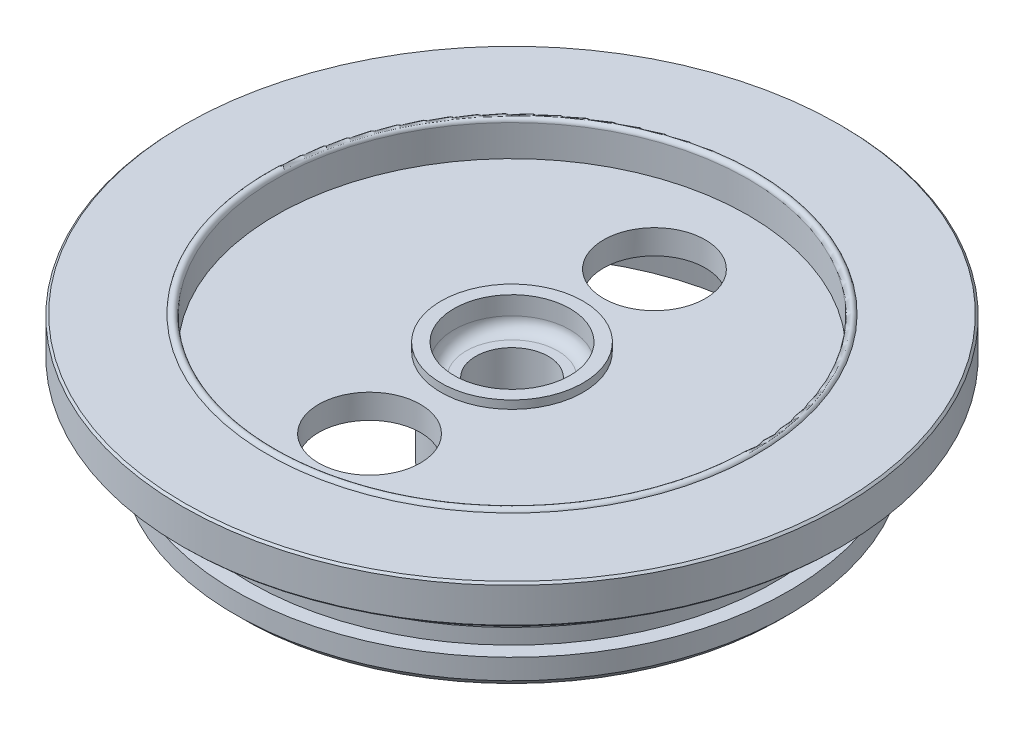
ISO-10303-21;
HEADER;
FILE_DESCRIPTION(('STEP AP214'),'2;1');
FILE_NAME('part.step','',(''),(''),'','','');
FILE_SCHEMA(('AUTOMOTIVE_DESIGN { 1 0 10303 214 1 1 1 1 }'));
ENDSEC;
DATA;
#1=APPLICATION_CONTEXT('core data for automotive mechanical design processes');
#2=APPLICATION_PROTOCOL_DEFINITION('international standard','automotive_design',2000,#1);
#3=PRODUCT_CONTEXT('',#1,'mechanical');
#4=PRODUCT('Part','Part','',(#3));
#5=PRODUCT_RELATED_PRODUCT_CATEGORY('part','',(#4));
#6=PRODUCT_DEFINITION_FORMATION('','',#4);
#7=PRODUCT_DEFINITION_CONTEXT('part definition',#1,'design');
#8=PRODUCT_DEFINITION('design','',#6,#7);
#9=PRODUCT_DEFINITION_SHAPE('','',#8);
#10=(LENGTH_UNIT() NAMED_UNIT(*) SI_UNIT(.MILLI.,.METRE.));
#11=(NAMED_UNIT(*) PLANE_ANGLE_UNIT() SI_UNIT($,.RADIAN.));
#12=(NAMED_UNIT(*) SI_UNIT($,.STERADIAN.) SOLID_ANGLE_UNIT());
#13=UNCERTAINTY_MEASURE_WITH_UNIT(LENGTH_MEASURE(1.E-05),#10,'distance_accuracy_value','');
#14=(GEOMETRIC_REPRESENTATION_CONTEXT(3) GLOBAL_UNCERTAINTY_ASSIGNED_CONTEXT((#13)) GLOBAL_UNIT_ASSIGNED_CONTEXT((#10,
#11,#12)) REPRESENTATION_CONTEXT('',''));
#15=CARTESIAN_POINT('',(0.,0.,0.));
#16=DIRECTION('',(0.,0.,1.));
#17=DIRECTION('',(1.,0.,0.));
#18=AXIS2_PLACEMENT_3D('',#15,#16,#17);
#19=CARTESIAN_POINT('',(0.,65.0403892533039,0.));
#20=DIRECTION('',(0.,-1.,0.));
#21=DIRECTION('',(0.,0.,-1.));
#22=AXIS2_PLACEMENT_3D('',#19,#20,#21);
#23=TOROIDAL_SURFACE('',#22,59.0036715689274,1.);
#24=CARTESIAN_POINT('',(0.,65.0403892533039,0.));
#25=DIRECTION('',(0.,-1.,0.));
#26=DIRECTION('',(0.,0.,-1.));
#27=AXIS2_PLACEMENT_3D('',#24,#25,#26);
#28=CIRCLE('',#27,58.0036715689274);
#29=CARTESIAN_POINT('',(0.,65.0403892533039,-58.0036715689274));
#30=VERTEX_POINT('',#29);
#31=EDGE_CURVE('E10',#30,#30,#28,.T.);
#32=ORIENTED_EDGE('',*,*,#31,.T.);
#33=EDGE_LOOP('',(#32));
#34=FACE_BOUND('',#33,.T.);
#35=CARTESIAN_POINT('',(0.,65.3610085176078,0.));
#36=DIRECTION('',(0.,-1.,0.));
#37=DIRECTION('',(0.,0.,-1.));
#38=AXIS2_PLACEMENT_3D('',#35,#36,#37);
#39=CIRCLE('',#38,59.9508797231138);
#40=CARTESIAN_POINT('',(0.,65.3610085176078,-59.9508797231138));
#41=VERTEX_POINT('',#40);
#42=EDGE_CURVE('E47',#41,#41,#39,.T.);
#43=ORIENTED_EDGE('',*,*,#42,.F.);
#44=EDGE_LOOP('',(#43));
#45=FACE_BOUND('',#44,.T.);
#46=ADVANCED_FACE('F30',(#34,#45),#23,.T.);
#47=CARTESIAN_POINT('',(0.,0.,0.));
#48=DIRECTION('',(0.,-1.,0.));
#49=DIRECTION('',(0.,0.,-1.));
#50=AXIS2_PLACEMENT_3D('',#47,#48,#49);
#51=CYLINDRICAL_SURFACE('',#50,58.0036715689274);
#52=CARTESIAN_POINT('',(0.,57.3610085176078,0.));
#53=DIRECTION('',(0.,-1.,0.));
#54=DIRECTION('',(0.,0.,-1.));
#55=AXIS2_PLACEMENT_3D('',#52,#53,#54);
#56=CIRCLE('',#55,58.0036715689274);
#57=CARTESIAN_POINT('',(0.,57.3610085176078,-58.0036715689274));
#58=VERTEX_POINT('',#57);
#59=EDGE_CURVE('E37',#58,#58,#56,.T.);
#60=ORIENTED_EDGE('',*,*,#59,.T.);
#61=EDGE_LOOP('',(#60));
#62=FACE_BOUND('',#61,.T.);
#63=ORIENTED_EDGE('',*,*,#31,.F.);
#64=EDGE_LOOP('',(#63));
#65=FACE_BOUND('',#64,.T.);
#66=ADVANCED_FACE('F150',(#62,#65),#51,.F.);
#67=CARTESIAN_POINT('',(58.0036715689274,57.3610085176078,0.));
#68=DIRECTION('',(0.,1.,0.));
#69=DIRECTION('',(0.,0.,1.));
#70=AXIS2_PLACEMENT_3D('',#67,#68,#69);
#71=PLANE('',#70);
#72=CARTESIAN_POINT('',(0.,57.3610085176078,35.));
#73=DIRECTION('',(0.,1.,0.));
#74=DIRECTION('',(0.,0.,1.));
#75=AXIS2_PLACEMENT_3D('',#72,#73,#74);
#76=CIRCLE('',#75,12.5);
#77=CARTESIAN_POINT('',(0.,57.3610085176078,47.5));
#78=VERTEX_POINT('',#77);
#79=EDGE_CURVE('E59',#78,#78,#76,.T.);
#80=ORIENTED_EDGE('',*,*,#79,.F.);
#81=EDGE_LOOP('',(#80));
#82=FACE_BOUND('',#81,.T.);
#83=CARTESIAN_POINT('',(0.,57.3610085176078,-35.));
#84=DIRECTION('',(0.,1.,0.));
#85=DIRECTION('',(0.,0.,1.));
#86=AXIS2_PLACEMENT_3D('',#83,#84,#85);
#87=CIRCLE('',#86,12.5);
#88=CARTESIAN_POINT('',(0.,57.3610085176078,-22.5));
#89=VERTEX_POINT('',#88);
#90=EDGE_CURVE('E48',#89,#89,#87,.T.);
#91=ORIENTED_EDGE('',*,*,#90,.F.);
#92=EDGE_LOOP('',(#91));
#93=FACE_BOUND('',#92,.T.);
#94=CARTESIAN_POINT('',(0.,57.3610085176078,0.));
#95=DIRECTION('',(0.,-1.,0.));
#96=DIRECTION('',(0.,0.,-1.));
#97=AXIS2_PLACEMENT_3D('',#94,#95,#96);
#98=CIRCLE('',#97,17.45);
#99=CARTESIAN_POINT('',(0.,57.3610085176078,-17.45));
#100=VERTEX_POINT('',#99);
#101=EDGE_CURVE('E42',#100,#100,#98,.T.);
#102=ORIENTED_EDGE('',*,*,#101,.T.);
#103=EDGE_LOOP('',(#102));
#104=FACE_BOUND('',#103,.T.);
#105=ORIENTED_EDGE('',*,*,#59,.F.);
#106=EDGE_LOOP('',(#105));
#107=FACE_BOUND('',#106,.T.);
#108=ADVANCED_FACE('F135',(#82,#93,#104,#107),#71,.T.);
#109=CARTESIAN_POINT('',(0.,0.,0.));
#110=DIRECTION('',(0.,-1.,0.));
#111=DIRECTION('',(0.,0.,-1.));
#112=AXIS2_PLACEMENT_3D('',#109,#110,#111);
#113=CYLINDRICAL_SURFACE('',#112,17.45);
#114=CARTESIAN_POINT('',(0.,59.3610085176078,0.));
#115=DIRECTION('',(0.,-1.,0.));
#116=DIRECTION('',(0.,0.,-1.));
#117=AXIS2_PLACEMENT_3D('',#114,#115,#116);
#118=CIRCLE('',#117,17.45);
#119=CARTESIAN_POINT('',(0.,59.3610085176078,-17.45));
#120=VERTEX_POINT('',#119);
#121=EDGE_CURVE('E130',#120,#120,#118,.T.);
#122=ORIENTED_EDGE('',*,*,#121,.T.);
#123=EDGE_LOOP('',(#122));
#124=FACE_BOUND('',#123,.T.);
#125=ORIENTED_EDGE('',*,*,#101,.F.);
#126=EDGE_LOOP('',(#125));
#127=FACE_BOUND('',#126,.T.);
#128=ADVANCED_FACE('F138',(#124,#127),#113,.T.);
#129=CARTESIAN_POINT('',(17.45,59.3610085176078,0.));
#130=DIRECTION('',(0.,1.,0.));
#131=DIRECTION('',(0.,0.,1.));
#132=AXIS2_PLACEMENT_3D('',#129,#130,#131);
#133=PLANE('',#132);
#134=CARTESIAN_POINT('',(0.,59.3610085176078,0.));
#135=DIRECTION('',(0.,-1.,0.));
#136=DIRECTION('',(0.,0.,-1.));
#137=AXIS2_PLACEMENT_3D('',#134,#135,#136);
#138=CIRCLE('',#137,14.25);
#139=CARTESIAN_POINT('',(0.,59.3610085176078,-14.25));
#140=VERTEX_POINT('',#139);
#141=EDGE_CURVE('E127',#140,#140,#138,.T.);
#142=ORIENTED_EDGE('',*,*,#141,.T.);
#143=EDGE_LOOP('',(#142));
#144=FACE_BOUND('',#143,.T.);
#145=ORIENTED_EDGE('',*,*,#121,.F.);
#146=EDGE_LOOP('',(#145));
#147=FACE_BOUND('',#146,.T.);
#148=ADVANCED_FACE('F140',(#144,#147),#133,.T.);
#149=CARTESIAN_POINT('',(0.,0.,0.));
#150=DIRECTION('',(0.,-1.,0.));
#151=DIRECTION('',(0.,0.,-1.));
#152=AXIS2_PLACEMENT_3D('',#149,#150,#151);
#153=CYLINDRICAL_SURFACE('',#152,14.25);
#154=CARTESIAN_POINT('',(0.,54.8610085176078,0.));
#155=DIRECTION('',(0.,-1.,0.));
#156=DIRECTION('',(0.,0.,-1.));
#157=AXIS2_PLACEMENT_3D('',#154,#155,#156);
#158=CIRCLE('',#157,14.25);
#159=CARTESIAN_POINT('',(0.,54.8610085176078,-14.25));
#160=VERTEX_POINT('',#159);
#161=EDGE_CURVE('E124',#160,#160,#158,.T.);
#162=ORIENTED_EDGE('',*,*,#161,.T.);
#163=EDGE_LOOP('',(#162));
#164=FACE_BOUND('',#163,.T.);
#165=ORIENTED_EDGE('',*,*,#141,.F.);
#166=EDGE_LOOP('',(#165));
#167=FACE_BOUND('',#166,.T.);
#168=ADVANCED_FACE('F147',(#164,#167),#153,.F.);
#169=CARTESIAN_POINT('',(0.,54.8610085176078,0.));
#170=DIRECTION('',(0.,-1.,0.));
#171=DIRECTION('',(0.,0.,-1.));
#172=AXIS2_PLACEMENT_3D('',#169,#170,#171);
#173=TOROIDAL_SURFACE('',#172,11.25,3.);
#174=CARTESIAN_POINT('',(0.,51.8610085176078,0.));
#175=DIRECTION('',(0.,-1.,0.));
#176=DIRECTION('',(0.,0.,-1.));
#177=AXIS2_PLACEMENT_3D('',#174,#175,#176);
#178=CIRCLE('',#177,11.25);
#179=CARTESIAN_POINT('',(0.,51.8610085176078,-11.25));
#180=VERTEX_POINT('',#179);
#181=EDGE_CURVE('E121',#180,#180,#178,.T.);
#182=ORIENTED_EDGE('',*,*,#181,.T.);
#183=EDGE_LOOP('',(#182));
#184=FACE_BOUND('',#183,.T.);
#185=ORIENTED_EDGE('',*,*,#161,.F.);
#186=EDGE_LOOP('',(#185));
#187=FACE_BOUND('',#186,.T.);
#188=ADVANCED_FACE('F286',(#184,#187),#173,.F.);
#189=CARTESIAN_POINT('',(8.925,51.8610085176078,0.));
#190=DIRECTION('',(0.,1.,0.));
#191=DIRECTION('',(0.,0.,1.));
#192=AXIS2_PLACEMENT_3D('',#189,#190,#191);
#193=PLANE('',#192);
#194=CARTESIAN_POINT('',(0.,51.8610085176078,0.));
#195=DIRECTION('',(0.,-1.,0.));
#196=DIRECTION('',(0.,0.,-1.));
#197=AXIS2_PLACEMENT_3D('',#194,#195,#196);
#198=CIRCLE('',#197,8.925);
#199=CARTESIAN_POINT('',(0.,51.8610085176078,-8.925));
#200=VERTEX_POINT('',#199);
#201=EDGE_CURVE('E118',#200,#200,#198,.T.);
#202=ORIENTED_EDGE('',*,*,#201,.T.);
#203=EDGE_LOOP('',(#202));
#204=FACE_BOUND('',#203,.T.);
#205=ORIENTED_EDGE('',*,*,#181,.F.);
#206=EDGE_LOOP('',(#205));
#207=FACE_BOUND('',#206,.T.);
#208=ADVANCED_FACE('F280',(#204,#207),#193,.T.);
#209=CARTESIAN_POINT('',(0.,0.,0.));
#210=DIRECTION('',(0.,-1.,0.));
#211=DIRECTION('',(0.,0.,-1.));
#212=AXIS2_PLACEMENT_3D('',#209,#210,#211);
#213=CYLINDRICAL_SURFACE('',#212,8.925);
#214=CARTESIAN_POINT('',(0.,5.36100851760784,0.));
#215=DIRECTION('',(0.,-1.,0.));
#216=DIRECTION('',(0.,0.,-1.));
#217=AXIS2_PLACEMENT_3D('',#214,#215,#216);
#218=CIRCLE('',#217,8.92499999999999);
#219=CARTESIAN_POINT('',(0.,5.36100851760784,-8.92499999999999));
#220=VERTEX_POINT('',#219);
#221=EDGE_CURVE('E115',#220,#220,#218,.T.);
#222=ORIENTED_EDGE('',*,*,#221,.T.);
#223=EDGE_LOOP('',(#222));
#224=FACE_BOUND('',#223,.T.);
#225=ORIENTED_EDGE('',*,*,#201,.F.);
#226=EDGE_LOOP('',(#225));
#227=FACE_BOUND('',#226,.T.);
#228=ADVANCED_FACE('F274',(#224,#227),#213,.F.);
#229=CARTESIAN_POINT('',(8.92499999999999,5.36100851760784,0.));
#230=DIRECTION('',(0.,-1.,0.));
#231=DIRECTION('',(0.,0.,-1.));
#232=AXIS2_PLACEMENT_3D('',#229,#230,#231);
#233=PLANE('',#232);
#234=CARTESIAN_POINT('',(0.,5.36100851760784,0.));
#235=DIRECTION('',(0.,-1.,0.));
#236=DIRECTION('',(0.,0.,-1.));
#237=AXIS2_PLACEMENT_3D('',#234,#235,#236);
#238=CIRCLE('',#237,12.8);
#239=CARTESIAN_POINT('',(0.,5.36100851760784,-12.8));
#240=VERTEX_POINT('',#239);
#241=EDGE_CURVE('E112',#240,#240,#238,.T.);
#242=ORIENTED_EDGE('',*,*,#241,.T.);
#243=EDGE_LOOP('',(#242));
#244=FACE_BOUND('',#243,.T.);
#245=ORIENTED_EDGE('',*,*,#221,.F.);
#246=EDGE_LOOP('',(#245));
#247=FACE_BOUND('',#246,.T.);
#248=ADVANCED_FACE('F268',(#244,#247),#233,.T.);
#249=CARTESIAN_POINT('',(0.,5.36100851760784,0.));
#250=DIRECTION('',(0.,1.,0.));
#251=DIRECTION('',(0.,0.,1.));
#252=AXIS2_PLACEMENT_3D('',#249,#250,#251);
#253=CONICAL_SURFACE('',#252,12.8,0.785398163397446);
#254=CARTESIAN_POINT('',(0.,6.36100851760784,0.));
#255=DIRECTION('',(0.,-1.,0.));
#256=DIRECTION('',(0.,0.,-1.));
#257=AXIS2_PLACEMENT_3D('',#254,#255,#256);
#258=CIRCLE('',#257,13.8);
#259=CARTESIAN_POINT('',(0.,6.36100851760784,-13.8));
#260=VERTEX_POINT('',#259);
#261=EDGE_CURVE('E109',#260,#260,#258,.T.);
#262=ORIENTED_EDGE('',*,*,#261,.T.);
#263=EDGE_LOOP('',(#262));
#264=FACE_BOUND('',#263,.T.);
#265=ORIENTED_EDGE('',*,*,#241,.F.);
#266=EDGE_LOOP('',(#265));
#267=FACE_BOUND('',#266,.T.);
#268=ADVANCED_FACE('F262',(#264,#267),#253,.T.);
#269=CARTESIAN_POINT('',(0.,0.,0.));
#270=DIRECTION('',(0.,-1.,0.));
#271=DIRECTION('',(0.,0.,-1.));
#272=AXIS2_PLACEMENT_3D('',#269,#270,#271);
#273=CYLINDRICAL_SURFACE('',#272,13.8);
#274=CARTESIAN_POINT('',(0.,34.4986106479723,0.));
#275=DIRECTION('',(0.,-1.,0.));
#276=DIRECTION('',(0.,0.,-1.));
#277=AXIS2_PLACEMENT_3D('',#274,#275,#276);
#278=CIRCLE('',#277,13.8);
#279=CARTESIAN_POINT('',(0.,34.4986106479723,-13.8));
#280=VERTEX_POINT('',#279);
#281=EDGE_CURVE('E106',#280,#280,#278,.T.);
#282=ORIENTED_EDGE('',*,*,#281,.T.);
#283=EDGE_LOOP('',(#282));
#284=FACE_BOUND('',#283,.T.);
#285=ORIENTED_EDGE('',*,*,#261,.F.);
#286=EDGE_LOOP('',(#285));
#287=FACE_BOUND('',#286,.T.);
#288=ADVANCED_FACE('F256',(#284,#287),#273,.T.);
#289=CARTESIAN_POINT('',(13.8,34.4986106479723,0.));
#290=DIRECTION('',(0.,-1.,0.));
#291=DIRECTION('',(0.,0.,-1.));
#292=AXIS2_PLACEMENT_3D('',#289,#290,#291);
#293=PLANE('',#292);
#294=CARTESIAN_POINT('',(0.,34.4986106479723,0.));
#295=DIRECTION('',(0.,-1.,0.));
#296=DIRECTION('',(0.,0.,-1.));
#297=AXIS2_PLACEMENT_3D('',#294,#295,#296);
#298=CIRCLE('',#297,16.8);
#299=CARTESIAN_POINT('',(0.,34.4986106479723,-16.8));
#300=VERTEX_POINT('',#299);
#301=EDGE_CURVE('E103',#300,#300,#298,.T.);
#302=ORIENTED_EDGE('',*,*,#301,.T.);
#303=EDGE_LOOP('',(#302));
#304=FACE_BOUND('',#303,.T.);
#305=ORIENTED_EDGE('',*,*,#281,.F.);
#306=EDGE_LOOP('',(#305));
#307=FACE_BOUND('',#306,.T.);
#308=ADVANCED_FACE('F250',(#304,#307),#293,.T.);
#309=CARTESIAN_POINT('',(0.,0.,0.));
#310=DIRECTION('',(0.,-1.,0.));
#311=DIRECTION('',(0.,0.,-1.));
#312=AXIS2_PLACEMENT_3D('',#309,#310,#311);
#313=CYLINDRICAL_SURFACE('',#312,16.8);
#314=CARTESIAN_POINT('',(0.,51.3610085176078,0.));
#315=DIRECTION('',(0.,-1.,0.));
#316=DIRECTION('',(0.,0.,-1.));
#317=AXIS2_PLACEMENT_3D('',#314,#315,#316);
#318=CIRCLE('',#317,16.8);
#319=CARTESIAN_POINT('',(0.,51.3610085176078,-16.8));
#320=VERTEX_POINT('',#319);
#321=EDGE_CURVE('E100',#320,#320,#318,.T.);
#322=ORIENTED_EDGE('',*,*,#321,.T.);
#323=EDGE_LOOP('',(#322));
#324=FACE_BOUND('',#323,.T.);
#325=ORIENTED_EDGE('',*,*,#301,.F.);
#326=EDGE_LOOP('',(#325));
#327=FACE_BOUND('',#326,.T.);
#328=ADVANCED_FACE('F243',(#324,#327),#313,.T.);
#329=CARTESIAN_POINT('',(16.8,51.3610085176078,0.));
#330=DIRECTION('',(0.,-1.,0.));
#331=DIRECTION('',(0.,0.,-1.));
#332=AXIS2_PLACEMENT_3D('',#329,#330,#331);
#333=PLANE('',#332);
#334=CARTESIAN_POINT('',(0.,51.3610085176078,35.));
#335=DIRECTION('',(0.,-1.,0.));
#336=DIRECTION('',(0.,0.,-1.));
#337=AXIS2_PLACEMENT_3D('',#334,#335,#336);
#338=CIRCLE('',#337,12.5);
#339=CARTESIAN_POINT('',(0.,51.3610085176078,22.5));
#340=VERTEX_POINT('',#339);
#341=EDGE_CURVE('E33',#340,#340,#338,.T.);
#342=ORIENTED_EDGE('',*,*,#341,.F.);
#343=EDGE_LOOP('',(#342));
#344=FACE_BOUND('',#343,.T.);
#345=CARTESIAN_POINT('',(0.,51.3610085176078,-35.));
#346=DIRECTION('',(0.,-1.,0.));
#347=DIRECTION('',(0.,0.,-1.));
#348=AXIS2_PLACEMENT_3D('',#345,#346,#347);
#349=CIRCLE('',#348,12.5);
#350=CARTESIAN_POINT('',(0.,51.3610085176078,-47.5));
#351=VERTEX_POINT('',#350);
#352=EDGE_CURVE('E45',#351,#351,#349,.T.);
#353=ORIENTED_EDGE('',*,*,#352,.F.);
#354=EDGE_LOOP('',(#353));
#355=FACE_BOUND('',#354,.T.);
#356=CARTESIAN_POINT('',(0.,51.3610085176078,0.));
#357=DIRECTION('',(0.,-1.,0.));
#358=DIRECTION('',(0.,0.,-1.));
#359=AXIS2_PLACEMENT_3D('',#356,#357,#358);
#360=CIRCLE('',#359,59.6490800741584);
#361=CARTESIAN_POINT('',(0.,51.3610085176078,-59.6490800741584));
#362=VERTEX_POINT('',#361);
#363=EDGE_CURVE('E97',#362,#362,#360,.T.);
#364=ORIENTED_EDGE('',*,*,#363,.T.);
#365=EDGE_LOOP('',(#364));
#366=FACE_BOUND('',#365,.T.);
#367=ORIENTED_EDGE('',*,*,#321,.F.);
#368=EDGE_LOOP('',(#367));
#369=FACE_BOUND('',#368,.T.);
#370=ADVANCED_FACE('F237',(#344,#355,#366,#369),#333,.T.);
#371=CARTESIAN_POINT('',(0.,51.3610085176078,0.));
#372=DIRECTION('',(0.,-1.,0.));
#373=DIRECTION('',(0.,0.,-1.));
#374=AXIS2_PLACEMENT_3D('',#371,#372,#373);
#375=CONICAL_SURFACE('',#374,59.6490800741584,0.157079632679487);
#376=CARTESIAN_POINT('',(0.,33.3610085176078,0.));
#377=DIRECTION('',(0.,-1.,0.));
#378=DIRECTION('',(0.,0.,-1.));
#379=AXIS2_PLACEMENT_3D('',#376,#377,#378);
#380=CIRCLE('',#379,62.5);
#381=CARTESIAN_POINT('',(0.,33.3610085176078,-62.5));
#382=VERTEX_POINT('',#381);
#383=EDGE_CURVE('E94',#382,#382,#380,.T.);
#384=ORIENTED_EDGE('',*,*,#383,.T.);
#385=EDGE_LOOP('',(#384));
#386=FACE_BOUND('',#385,.T.);
#387=ORIENTED_EDGE('',*,*,#363,.F.);
#388=EDGE_LOOP('',(#387));
#389=FACE_BOUND('',#388,.T.);
#390=ADVANCED_FACE('F231',(#386,#389),#375,.F.);
#391=CARTESIAN_POINT('',(62.5,33.3610085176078,0.));
#392=DIRECTION('',(0.,-1.,0.));
#393=DIRECTION('',(0.,0.,-1.));
#394=AXIS2_PLACEMENT_3D('',#391,#392,#393);
#395=PLANE('',#394);
#396=CARTESIAN_POINT('',(0.,33.3610085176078,0.));
#397=DIRECTION('',(0.,-1.,0.));
#398=DIRECTION('',(0.,0.,-1.));
#399=AXIS2_PLACEMENT_3D('',#396,#397,#398);
#400=CIRCLE('',#399,66.);
#401=CARTESIAN_POINT('',(0.,33.3610085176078,-66.));
#402=VERTEX_POINT('',#401);
#403=EDGE_CURVE('E91',#402,#402,#400,.T.);
#404=ORIENTED_EDGE('',*,*,#403,.T.);
#405=EDGE_LOOP('',(#404));
#406=FACE_BOUND('',#405,.T.);
#407=ORIENTED_EDGE('',*,*,#383,.F.);
#408=EDGE_LOOP('',(#407));
#409=FACE_BOUND('',#408,.T.);
#410=ADVANCED_FACE('F225',(#406,#409),#395,.T.);
#411=CARTESIAN_POINT('',(0.,33.3610085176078,0.));
#412=DIRECTION('',(0.,1.,0.));
#413=DIRECTION('',(0.,0.,1.));
#414=AXIS2_PLACEMENT_3D('',#411,#412,#413);
#415=CONICAL_SURFACE('',#414,66.,0.785398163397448);
#416=CARTESIAN_POINT('',(0.,35.3610085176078,0.));
#417=DIRECTION('',(0.,-1.,0.));
#418=DIRECTION('',(0.,0.,-1.));
#419=AXIS2_PLACEMENT_3D('',#416,#417,#418);
#420=CIRCLE('',#419,68.);
#421=CARTESIAN_POINT('',(0.,35.3610085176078,-68.));
#422=VERTEX_POINT('',#421);
#423=EDGE_CURVE('E88',#422,#422,#420,.T.);
#424=ORIENTED_EDGE('',*,*,#423,.T.);
#425=EDGE_LOOP('',(#424));
#426=FACE_BOUND('',#425,.T.);
#427=ORIENTED_EDGE('',*,*,#403,.F.);
#428=EDGE_LOOP('',(#427));
#429=FACE_BOUND('',#428,.T.);
#430=ADVANCED_FACE('F219',(#426,#429),#415,.T.);
#431=CARTESIAN_POINT('',(0.,0.,0.));
#432=DIRECTION('',(0.,-1.,0.));
#433=DIRECTION('',(0.,0.,-1.));
#434=AXIS2_PLACEMENT_3D('',#431,#432,#433);
#435=CYLINDRICAL_SURFACE('',#434,68.);
#436=CARTESIAN_POINT('',(0.,40.3610085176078,0.));
#437=DIRECTION('',(0.,-1.,0.));
#438=DIRECTION('',(0.,0.,-1.));
#439=AXIS2_PLACEMENT_3D('',#436,#437,#438);
#440=CIRCLE('',#439,68.);
#441=CARTESIAN_POINT('',(0.,40.3610085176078,-68.));
#442=VERTEX_POINT('',#441);
#443=EDGE_CURVE('E85',#442,#442,#440,.T.);
#444=ORIENTED_EDGE('',*,*,#443,.T.);
#445=EDGE_LOOP('',(#444));
#446=FACE_BOUND('',#445,.T.);
#447=ORIENTED_EDGE('',*,*,#423,.F.);
#448=EDGE_LOOP('',(#447));
#449=FACE_BOUND('',#448,.T.);
#450=ADVANCED_FACE('F213',(#446,#449),#435,.T.);
#451=CARTESIAN_POINT('',(64.35,40.3610085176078,0.));
#452=DIRECTION('',(0.,1.,0.));
#453=DIRECTION('',(0.,0.,1.));
#454=AXIS2_PLACEMENT_3D('',#451,#452,#453);
#455=PLANE('',#454);
#456=CARTESIAN_POINT('',(0.,40.3610085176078,0.));
#457=DIRECTION('',(0.,-1.,0.));
#458=DIRECTION('',(0.,0.,-1.));
#459=AXIS2_PLACEMENT_3D('',#456,#457,#458);
#460=CIRCLE('',#459,64.35);
#461=CARTESIAN_POINT('',(0.,40.3610085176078,-64.35));
#462=VERTEX_POINT('',#461);
#463=EDGE_CURVE('E82',#462,#462,#460,.T.);
#464=ORIENTED_EDGE('',*,*,#463,.T.);
#465=EDGE_LOOP('',(#464));
#466=FACE_BOUND('',#465,.T.);
#467=ORIENTED_EDGE('',*,*,#443,.F.);
#468=EDGE_LOOP('',(#467));
#469=FACE_BOUND('',#468,.T.);
#470=ADVANCED_FACE('F207',(#466,#469),#455,.T.);
#471=CARTESIAN_POINT('',(0.,0.,0.));
#472=DIRECTION('',(0.,-1.,0.));
#473=DIRECTION('',(0.,0.,-1.));
#474=AXIS2_PLACEMENT_3D('',#471,#472,#473);
#475=CYLINDRICAL_SURFACE('',#474,64.35);
#476=CARTESIAN_POINT('',(0.,46.7110085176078,0.));
#477=DIRECTION('',(0.,-1.,0.));
#478=DIRECTION('',(0.,0.,-1.));
#479=AXIS2_PLACEMENT_3D('',#476,#477,#478);
#480=CIRCLE('',#479,64.35);
#481=CARTESIAN_POINT('',(0.,46.7110085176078,-64.35));
#482=VERTEX_POINT('',#481);
#483=EDGE_CURVE('E79',#482,#482,#480,.T.);
#484=ORIENTED_EDGE('',*,*,#483,.T.);
#485=EDGE_LOOP('',(#484));
#486=FACE_BOUND('',#485,.T.);
#487=ORIENTED_EDGE('',*,*,#463,.F.);
#488=EDGE_LOOP('',(#487));
#489=FACE_BOUND('',#488,.T.);
#490=ADVANCED_FACE('F201',(#486,#489),#475,.T.);
#491=CARTESIAN_POINT('',(68.,46.7110085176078,0.));
#492=DIRECTION('',(0.,-1.,0.));
#493=DIRECTION('',(0.,0.,-1.));
#494=AXIS2_PLACEMENT_3D('',#491,#492,#493);
#495=PLANE('',#494);
#496=CARTESIAN_POINT('',(0.,46.7110085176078,0.));
#497=DIRECTION('',(0.,-1.,0.));
#498=DIRECTION('',(0.,0.,-1.));
#499=AXIS2_PLACEMENT_3D('',#496,#497,#498);
#500=CIRCLE('',#499,68.);
#501=CARTESIAN_POINT('',(0.,46.7110085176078,-68.));
#502=VERTEX_POINT('',#501);
#503=EDGE_CURVE('E76',#502,#502,#500,.T.);
#504=ORIENTED_EDGE('',*,*,#503,.T.);
#505=EDGE_LOOP('',(#504));
#506=FACE_BOUND('',#505,.T.);
#507=ORIENTED_EDGE('',*,*,#483,.F.);
#508=EDGE_LOOP('',(#507));
#509=FACE_BOUND('',#508,.T.);
#510=ADVANCED_FACE('F195',(#506,#509),#495,.T.);
#511=CARTESIAN_POINT('',(0.,0.,0.));
#512=DIRECTION('',(0.,-1.,0.));
#513=DIRECTION('',(0.,0.,-1.));
#514=AXIS2_PLACEMENT_3D('',#511,#512,#513);
#515=CYLINDRICAL_SURFACE('',#514,68.);
#516=CARTESIAN_POINT('',(0.,55.8610085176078,0.));
#517=DIRECTION('',(0.,-1.,0.));
#518=DIRECTION('',(0.,0.,-1.));
#519=AXIS2_PLACEMENT_3D('',#516,#517,#518);
#520=CIRCLE('',#519,68.);
#521=CARTESIAN_POINT('',(0.,55.8610085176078,-68.));
#522=VERTEX_POINT('',#521);
#523=EDGE_CURVE('E73',#522,#522,#520,.T.);
#524=ORIENTED_EDGE('',*,*,#523,.T.);
#525=EDGE_LOOP('',(#524));
#526=FACE_BOUND('',#525,.T.);
#527=ORIENTED_EDGE('',*,*,#503,.F.);
#528=EDGE_LOOP('',(#527));
#529=FACE_BOUND('',#528,.T.);
#530=ADVANCED_FACE('F189',(#526,#529),#515,.T.);
#531=CARTESIAN_POINT('',(68.,55.8610085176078,0.));
#532=DIRECTION('',(0.,-1.,0.));
#533=DIRECTION('',(0.,0.,-1.));
#534=AXIS2_PLACEMENT_3D('',#531,#532,#533);
#535=PLANE('',#534);
#536=CARTESIAN_POINT('',(0.,55.8610085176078,0.));
#537=DIRECTION('',(0.,-1.,0.));
#538=DIRECTION('',(0.,0.,-1.));
#539=AXIS2_PLACEMENT_3D('',#536,#537,#538);
#540=CIRCLE('',#539,80.5);
#541=CARTESIAN_POINT('',(0.,55.8610085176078,-80.5));
#542=VERTEX_POINT('',#541);
#543=EDGE_CURVE('E70',#542,#542,#540,.T.);
#544=ORIENTED_EDGE('',*,*,#543,.T.);
#545=EDGE_LOOP('',(#544));
#546=FACE_BOUND('',#545,.T.);
#547=ORIENTED_EDGE('',*,*,#523,.F.);
#548=EDGE_LOOP('',(#547));
#549=FACE_BOUND('',#548,.T.);
#550=ADVANCED_FACE('F183',(#546,#549),#535,.T.);
#551=CARTESIAN_POINT('',(0.,55.8610085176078,0.));
#552=DIRECTION('',(0.,1.,0.));
#553=DIRECTION('',(0.,0.,1.));
#554=AXIS2_PLACEMENT_3D('',#551,#552,#553);
#555=CONICAL_SURFACE('',#554,80.5,0.785398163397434);
#556=CARTESIAN_POINT('',(0.,56.3610085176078,0.));
#557=DIRECTION('',(0.,-1.,0.));
#558=DIRECTION('',(0.,0.,-1.));
#559=AXIS2_PLACEMENT_3D('',#556,#557,#558);
#560=CIRCLE('',#559,81.);
#561=CARTESIAN_POINT('',(0.,56.3610085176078,-81.));
#562=VERTEX_POINT('',#561);
#563=EDGE_CURVE('E67',#562,#562,#560,.T.);
#564=ORIENTED_EDGE('',*,*,#563,.T.);
#565=EDGE_LOOP('',(#564));
#566=FACE_BOUND('',#565,.T.);
#567=ORIENTED_EDGE('',*,*,#543,.F.);
#568=EDGE_LOOP('',(#567));
#569=FACE_BOUND('',#568,.T.);
#570=ADVANCED_FACE('F177',(#566,#569),#555,.T.);
#571=CARTESIAN_POINT('',(0.,0.,0.));
#572=DIRECTION('',(0.,-1.,0.));
#573=DIRECTION('',(0.,0.,-1.));
#574=AXIS2_PLACEMENT_3D('',#571,#572,#573);
#575=CYLINDRICAL_SURFACE('',#574,81.);
#576=CARTESIAN_POINT('',(0.,64.8610085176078,0.));
#577=DIRECTION('',(0.,-1.,0.));
#578=DIRECTION('',(0.,0.,-1.));
#579=AXIS2_PLACEMENT_3D('',#576,#577,#578);
#580=CIRCLE('',#579,81.);
#581=CARTESIAN_POINT('',(0.,64.8610085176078,-81.));
#582=VERTEX_POINT('',#581);
#583=EDGE_CURVE('E64',#582,#582,#580,.T.);
#584=ORIENTED_EDGE('',*,*,#583,.T.);
#585=EDGE_LOOP('',(#584));
#586=FACE_BOUND('',#585,.T.);
#587=ORIENTED_EDGE('',*,*,#563,.F.);
#588=EDGE_LOOP('',(#587));
#589=FACE_BOUND('',#588,.T.);
#590=ADVANCED_FACE('F171',(#586,#589),#575,.T.);
#591=CARTESIAN_POINT('',(0.,64.8610085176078,0.));
#592=DIRECTION('',(0.,-1.,0.));
#593=DIRECTION('',(0.,0.,-1.));
#594=AXIS2_PLACEMENT_3D('',#591,#592,#593);
#595=CONICAL_SURFACE('',#594,81.,0.785398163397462);
#596=CARTESIAN_POINT('',(0.,65.3610085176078,0.));
#597=DIRECTION('',(0.,-1.,0.));
#598=DIRECTION('',(0.,0.,-1.));
#599=AXIS2_PLACEMENT_3D('',#596,#597,#598);
#600=CIRCLE('',#599,80.5);
#601=CARTESIAN_POINT('',(0.,65.3610085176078,-80.5));
#602=VERTEX_POINT('',#601);
#603=EDGE_CURVE('E52',#602,#602,#600,.T.);
#604=ORIENTED_EDGE('',*,*,#603,.T.);
#605=EDGE_LOOP('',(#604));
#606=FACE_BOUND('',#605,.T.);
#607=ORIENTED_EDGE('',*,*,#583,.F.);
#608=EDGE_LOOP('',(#607));
#609=FACE_BOUND('',#608,.T.);
#610=ADVANCED_FACE('F165',(#606,#609),#595,.T.);
#611=CARTESIAN_POINT('',(80.5,65.3610085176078,0.));
#612=DIRECTION('',(0.,1.,0.));
#613=DIRECTION('',(0.,0.,1.));
#614=AXIS2_PLACEMENT_3D('',#611,#612,#613);
#615=PLANE('',#614);
#616=ORIENTED_EDGE('',*,*,#42,.T.);
#617=EDGE_LOOP('',(#616));
#618=FACE_BOUND('',#617,.T.);
#619=ORIENTED_EDGE('',*,*,#603,.F.);
#620=EDGE_LOOP('',(#619));
#621=FACE_BOUND('',#620,.T.);
#622=ADVANCED_FACE('F161',(#618,#621),#615,.T.);
#623=CARTESIAN_POINT('',(0.,47.3610085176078,-35.));
#624=DIRECTION('',(0.,1.,0.));
#625=DIRECTION('',(0.,0.,1.));
#626=AXIS2_PLACEMENT_3D('',#623,#624,#625);
#627=CYLINDRICAL_SURFACE('',#626,12.5);
#628=ORIENTED_EDGE('',*,*,#352,.T.);
#629=EDGE_LOOP('',(#628));
#630=FACE_BOUND('',#629,.T.);
#631=ORIENTED_EDGE('',*,*,#90,.T.);
#632=EDGE_LOOP('',(#631));
#633=FACE_BOUND('',#632,.T.);
#634=ADVANCED_FACE('F164',(#630,#633),#627,.F.);
#635=CARTESIAN_POINT('',(0.,47.3610085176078,35.));
#636=DIRECTION('',(0.,1.,0.));
#637=DIRECTION('',(0.,0.,1.));
#638=AXIS2_PLACEMENT_3D('',#635,#636,#637);
#639=CYLINDRICAL_SURFACE('',#638,12.5);
#640=ORIENTED_EDGE('',*,*,#341,.T.);
#641=EDGE_LOOP('',(#640));
#642=FACE_BOUND('',#641,.T.);
#643=ORIENTED_EDGE('',*,*,#79,.T.);
#644=EDGE_LOOP('',(#643));
#645=FACE_BOUND('',#644,.T.);
#646=ADVANCED_FACE('F306',(#642,#645),#639,.F.);
#647=CLOSED_SHELL('',(#46,#66,#108,#128,#148,#168,#188,#208,#228,#248,#268,#288,#308,#328,#370,
#390,#410,#430,#450,#470,#490,#510,#530,#550,#570,#590,#610,#622,#634,#646));
#648=MANIFOLD_SOLID_BREP('B2',#647);
#649=ADVANCED_BREP_SHAPE_REPRESENTATION('',(#18,#648),#14);
#650=SHAPE_DEFINITION_REPRESENTATION(#9,#649);
ENDSEC;
END-ISO-10303-21;
